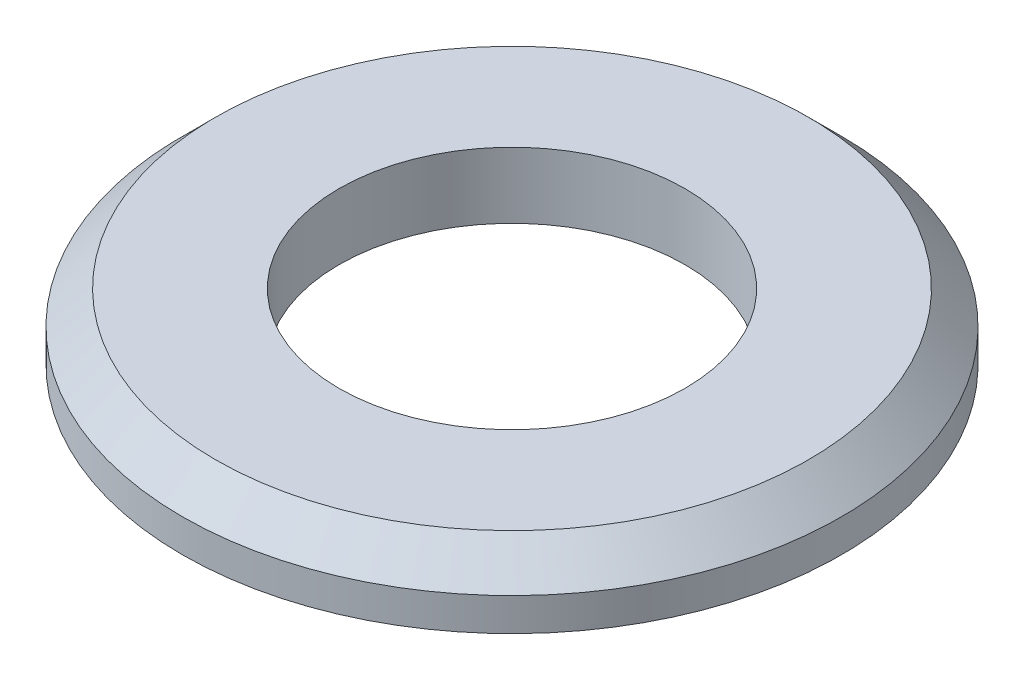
from build123d import *

# Parameters (mm, degrees)
SKETCH1_R      = 10
SKETCH1_R_2    = 5.25
EXTRUDE1_DEPTH = 2
CHAMFER1_SIZE  = 1


with BuildPart() as part:
    # Sketch1 → Extrude1 (new body)
    with BuildSketch(Plane(origin=(0, 0, 0), x_dir=(1, 0, 0), z_dir=(0, 1, 0))):
        with Locations(Location((0, 0, 0), (0, 0, 270))):
            Circle(SKETCH1_R)
        with Locations(Location((0, 0, 0), (0, 0, 270))):
            Circle(SKETCH1_R_2, mode=Mode.SUBTRACT)
    extrude(amount=EXTRUDE1_DEPTH)

    # Chamfer1
    chamfer1_edges = [part.edges().sort_by_distance(p)[0] for p in [
        (0, 2, -10),
    ]]
    chamfer(chamfer1_edges, length=CHAMFER1_SIZE)


solid = part.part
